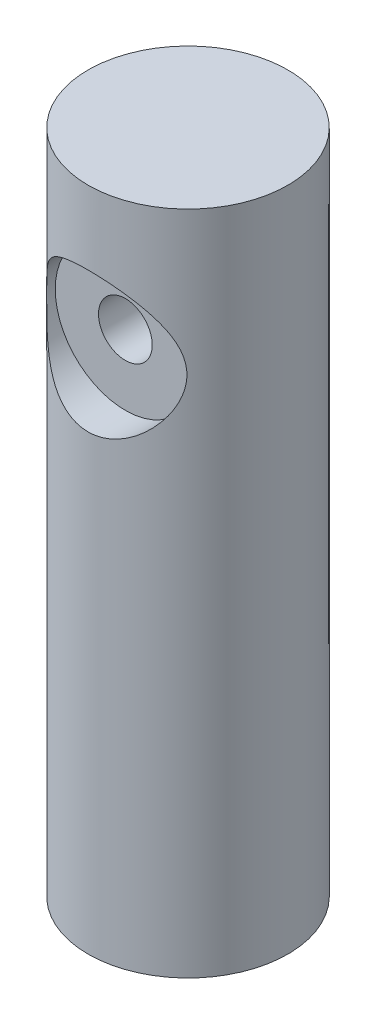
ISO-10303-21;
HEADER;
FILE_DESCRIPTION(('STEP AP214'),'2;1');
FILE_NAME('part.step','',(''),(''),'','','');
FILE_SCHEMA(('AUTOMOTIVE_DESIGN { 1 0 10303 214 1 1 1 1 }'));
ENDSEC;
DATA;
#1=APPLICATION_CONTEXT('core data for automotive mechanical design processes');
#2=APPLICATION_PROTOCOL_DEFINITION('international standard','automotive_design',2000,#1);
#3=PRODUCT_CONTEXT('',#1,'mechanical');
#4=PRODUCT('Part','Part','',(#3));
#5=PRODUCT_RELATED_PRODUCT_CATEGORY('part','',(#4));
#6=PRODUCT_DEFINITION_FORMATION('','',#4);
#7=PRODUCT_DEFINITION_CONTEXT('part definition',#1,'design');
#8=PRODUCT_DEFINITION('design','',#6,#7);
#9=PRODUCT_DEFINITION_SHAPE('','',#8);
#10=(LENGTH_UNIT() NAMED_UNIT(*) SI_UNIT(.MILLI.,.METRE.));
#11=(NAMED_UNIT(*) PLANE_ANGLE_UNIT() SI_UNIT($,.RADIAN.));
#12=(NAMED_UNIT(*) SI_UNIT($,.STERADIAN.) SOLID_ANGLE_UNIT());
#13=UNCERTAINTY_MEASURE_WITH_UNIT(LENGTH_MEASURE(1.E-05),#10,'distance_accuracy_value','');
#14=(GEOMETRIC_REPRESENTATION_CONTEXT(3) GLOBAL_UNCERTAINTY_ASSIGNED_CONTEXT((#13)) GLOBAL_UNIT_ASSIGNED_CONTEXT((#10,
#11,#12)) REPRESENTATION_CONTEXT('',''));
#15=CARTESIAN_POINT('',(0.,0.,0.));
#16=DIRECTION('',(0.,0.,1.));
#17=DIRECTION('',(1.,0.,0.));
#18=AXIS2_PLACEMENT_3D('',#15,#16,#17);
#19=CARTESIAN_POINT('',(0.,100.,0.));
#20=DIRECTION('',(0.,-1.,0.));
#21=DIRECTION('',(0.,0.,-1.));
#22=AXIS2_PLACEMENT_3D('',#19,#20,#21);
#23=CYLINDRICAL_SURFACE('',#22,15.);
#24=CARTESIAN_POINT('',(0.,67.9178628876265,15.));
#25=CARTESIAN_POINT('',(-0.261586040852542,67.9178616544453,15.0000011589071));
#26=CARTESIAN_POINT('',(-0.523157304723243,67.9276259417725,14.9931437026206));
#27=CARTESIAN_POINT('',(-1.04412788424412,67.9665175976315,14.9658886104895));
#28=CARTESIAN_POINT('',(-1.3035273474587,67.9956436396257,14.9454919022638));
#29=CARTESIAN_POINT('',(-1.81816208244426,68.0728013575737,14.8916503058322));
#30=CARTESIAN_POINT('',(-2.07339652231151,68.1208367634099,14.8582028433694));
#31=CARTESIAN_POINT('',(-2.57780900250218,68.2350956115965,14.7790420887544));
#32=CARTESIAN_POINT('',(-2.82698685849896,68.3013196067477,14.7333284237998));
#33=CARTESIAN_POINT('',(-3.31642499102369,68.4506686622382,14.6309099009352));
#34=CARTESIAN_POINT('',(-3.55672453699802,68.5337050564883,14.5742627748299));
#35=CARTESIAN_POINT('',(-4.0285553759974,68.7159341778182,14.4509595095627));
#36=CARTESIAN_POINT('',(-4.26008318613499,68.8151332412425,14.3842994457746));
#37=CARTESIAN_POINT('',(-4.71317375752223,69.0286080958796,14.2422731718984));
#38=CARTESIAN_POINT('',(-4.93474006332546,69.1428784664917,14.1669100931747));
#39=CARTESIAN_POINT('',(-5.36729789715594,69.3855789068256,14.0087534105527));
#40=CARTESIAN_POINT('',(-5.57828545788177,69.5140142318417,13.9259570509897));
#41=CARTESIAN_POINT('',(-6.00716027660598,69.7960277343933,13.746734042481));
#42=CARTESIAN_POINT('',(-6.22401264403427,69.9508245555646,13.6497493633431));
#43=CARTESIAN_POINT('',(-6.64385243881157,70.2750338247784,13.4503991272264));
#44=CARTESIAN_POINT('',(-6.84683941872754,70.4444467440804,13.3480333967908));
#45=CARTESIAN_POINT('',(-7.23882664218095,70.7972950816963,13.1395865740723));
#46=CARTESIAN_POINT('',(-7.42780508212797,70.9807514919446,13.0335000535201));
#47=CARTESIAN_POINT('',(-7.79101957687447,71.3607220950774,12.819688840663));
#48=CARTESIAN_POINT('',(-7.96525867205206,71.5572335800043,12.7119644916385));
#49=CARTESIAN_POINT('',(-8.32824462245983,71.9988150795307,12.4777750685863));
#50=CARTESIAN_POINT('',(-8.51408614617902,72.2463169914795,12.351373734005));
#51=CARTESIAN_POINT('',(-8.86415429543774,72.7581951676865,12.1025985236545));
#52=CARTESIAN_POINT('',(-9.02837527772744,73.0225758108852,11.980225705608));
#53=CARTESIAN_POINT('',(-9.33390099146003,73.5673085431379,11.7437455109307));
#54=CARTESIAN_POINT('',(-9.47523476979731,73.8476397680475,11.6296277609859));
#55=CARTESIAN_POINT('',(-9.73373583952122,74.423869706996,11.4141446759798));
#56=CARTESIAN_POINT('',(-9.85091590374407,74.719760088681,11.3127726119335));
#57=CARTESIAN_POINT('',(-10.0266710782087,75.231085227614,11.1568383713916));
#58=CARTESIAN_POINT('',(-10.0921128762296,75.4427383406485,11.0975522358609));
#59=CARTESIAN_POINT('',(-10.2100149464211,75.872160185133,10.9891769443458));
#60=CARTESIAN_POINT('',(-10.2624790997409,76.089927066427,10.9400847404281));
#61=CARTESIAN_POINT('',(-10.3536533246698,76.5302738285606,10.853838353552));
#62=CARTESIAN_POINT('',(-10.3923864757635,76.7528449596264,10.816664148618));
#63=CARTESIAN_POINT('',(-10.455584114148,77.2018310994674,10.7555893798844));
#64=CARTESIAN_POINT('',(-10.4800485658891,77.428246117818,10.7316888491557));
#65=CARTESIAN_POINT('',(-10.5143415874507,77.884587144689,10.6980937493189));
#66=CARTESIAN_POINT('',(-10.5240836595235,78.1145259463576,10.6884831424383));
#67=CARTESIAN_POINT('',(-10.5284551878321,78.5746821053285,10.6841771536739));
#68=CARTESIAN_POINT('',(-10.5230850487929,78.804899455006,10.6894813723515));
#69=CARTESIAN_POINT('',(-10.4973359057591,79.2638479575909,10.7147682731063));
#70=CARTESIAN_POINT('',(-10.4769454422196,79.4925778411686,10.7347621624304));
#71=CARTESIAN_POINT('',(-10.4215478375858,79.9466119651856,10.7885502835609));
#72=CARTESIAN_POINT('',(-10.3865390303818,80.1719158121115,10.8223460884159));
#73=CARTESIAN_POINT('',(-10.296716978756,80.6483663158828,10.9078859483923));
#74=CARTESIAN_POINT('',(-10.2398389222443,80.8987939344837,10.9614619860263));
#75=CARTESIAN_POINT('',(-10.1089960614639,81.3917455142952,11.0822426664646));
#76=CARTESIAN_POINT('',(-10.0350285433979,81.6342682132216,11.1494494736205));
#77=CARTESIAN_POINT('',(-9.87091680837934,82.1108004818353,11.2950006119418));
#78=CARTESIAN_POINT('',(-9.78074450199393,82.3447944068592,11.3733642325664));
#79=CARTESIAN_POINT('',(-9.58524761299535,82.8032182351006,11.5386053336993));
#80=CARTESIAN_POINT('',(-9.47992179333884,83.0276473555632,11.6254835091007));
#81=CARTESIAN_POINT('',(-9.22276211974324,83.5292437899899,11.8310995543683));
#82=CARTESIAN_POINT('',(-9.06623346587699,83.8031850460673,11.9518543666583));
#83=CARTESIAN_POINT('',(-8.73064684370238,84.334160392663,12.1991508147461));
#84=CARTESIAN_POINT('',(-8.55158305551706,84.5911900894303,12.3256939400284));
#85=CARTESIAN_POINT('',(-8.17169239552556,85.0879210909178,12.580772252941));
#86=CARTESIAN_POINT('',(-7.9708493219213,85.3276092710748,12.7093088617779));
#87=CARTESIAN_POINT('',(-7.54821027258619,85.7886284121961,12.9647790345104));
#88=CARTESIAN_POINT('',(-7.32641628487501,86.0099611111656,13.0917127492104));
#89=CARTESIAN_POINT('',(-6.8606281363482,86.4348689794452,13.3417466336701));
#90=CARTESIAN_POINT('',(-6.6164718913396,86.6382894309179,13.4648084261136));
#91=CARTESIAN_POINT('',(-6.10817806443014,87.0238998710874,13.702879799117));
#92=CARTESIAN_POINT('',(-5.84403860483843,87.2060878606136,13.8178886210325));
#93=CARTESIAN_POINT('',(-5.29735104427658,87.547024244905,14.0365443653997));
#94=CARTESIAN_POINT('',(-5.01483908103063,87.7058167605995,14.1402125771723));
#95=CARTESIAN_POINT('',(-4.43250385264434,87.9982087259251,14.3334192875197));
#96=CARTESIAN_POINT('',(-4.13268708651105,88.1318175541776,14.4229630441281));
#97=CARTESIAN_POINT('',(-3.59591399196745,88.3411938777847,14.5645374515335));
#98=CARTESIAN_POINT('',(-3.36229805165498,88.4230371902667,14.6203226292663));
#99=CARTESIAN_POINT('',(-2.88781496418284,88.5705422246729,14.7213897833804));
#100=CARTESIAN_POINT('',(-2.64694935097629,88.636207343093,14.7666739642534));
#101=CARTESIAN_POINT('',(-2.15949050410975,88.7505079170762,14.8457919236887));
#102=CARTESIAN_POINT('',(-1.91290032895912,88.7991522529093,14.8796316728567));
#103=CARTESIAN_POINT('',(-1.41551408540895,88.8787865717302,14.9351575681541));
#104=CARTESIAN_POINT('',(-1.16471789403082,88.9097760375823,14.9568433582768));
#105=CARTESIAN_POINT('',(-0.660068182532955,88.9536978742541,14.9876078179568));
#106=CARTESIAN_POINT('',(-0.406208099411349,88.9665797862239,14.9966512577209));
#107=CARTESIAN_POINT('',(0.101910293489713,88.9739245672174,15.0018054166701));
#108=CARTESIAN_POINT('',(0.356168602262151,88.9683874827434,14.9979161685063));
#109=CARTESIAN_POINT('',(0.863126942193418,88.9389791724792,14.9772955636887));
#110=CARTESIAN_POINT('',(1.11582676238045,88.9151055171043,14.9605625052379));
#111=CARTESIAN_POINT('',(1.61772065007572,88.8493843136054,14.9146398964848));
#112=CARTESIAN_POINT('',(1.86691476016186,88.8075369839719,14.8854504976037));
#113=CARTESIAN_POINT('',(2.35016176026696,88.7084990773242,14.8166767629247));
#114=CARTESIAN_POINT('',(2.58442133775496,88.6519901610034,14.7775555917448));
#115=CARTESIAN_POINT('',(3.04673491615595,88.5236602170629,14.6892066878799));
#116=CARTESIAN_POINT('',(3.27478912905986,88.4518397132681,14.6399793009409));
#117=CARTESIAN_POINT('',(3.72353488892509,88.2936801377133,14.5323271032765));
#118=CARTESIAN_POINT('',(3.94422699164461,88.2073421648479,14.4739029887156));
#119=CARTESIAN_POINT('',(4.37741055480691,88.0209454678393,14.3488371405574));
#120=CARTESIAN_POINT('',(4.58989898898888,87.920881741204,14.2821924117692));
#121=CARTESIAN_POINT('',(5.02590757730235,87.6976192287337,14.1349979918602));
#122=CARTESIAN_POINT('',(5.24851837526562,87.5731203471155,14.0537272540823));
#123=CARTESIAN_POINT('',(5.68224886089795,87.3096410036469,13.884030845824));
#124=CARTESIAN_POINT('',(5.89336362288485,87.170654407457,13.7956021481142));
#125=CARTESIAN_POINT('',(6.30357174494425,86.879101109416,13.613060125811));
#126=CARTESIAN_POINT('',(6.50265887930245,86.7265274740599,13.5189439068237));
#127=CARTESIAN_POINT('',(6.88829909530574,86.4086602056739,13.3265816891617));
#128=CARTESIAN_POINT('',(7.07485078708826,86.2433651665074,13.2283352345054));
#129=CARTESIAN_POINT('',(7.46715220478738,85.8702215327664,13.0115482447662));
#130=CARTESIAN_POINT('',(7.67040842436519,85.6600356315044,12.8925082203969));
#131=CARTESIAN_POINT('',(8.05856714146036,85.2237752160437,12.6535154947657));
#132=CARTESIAN_POINT('',(8.24346637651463,84.9976978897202,12.5335626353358));
#133=CARTESIAN_POINT('',(8.59436838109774,84.5302158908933,12.2956000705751));
#134=CARTESIAN_POINT('',(8.76036484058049,84.2888061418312,12.177591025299));
#135=CARTESIAN_POINT('',(9.07261766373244,83.791214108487,11.9467687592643));
#136=CARTESIAN_POINT('',(9.21887824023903,83.5350349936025,11.8339544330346));
#137=CARTESIAN_POINT('',(9.46599635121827,83.0561252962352,11.6368028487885));
#138=CARTESIAN_POINT('',(9.57027720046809,82.8357565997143,11.5510120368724));
#139=CARTESIAN_POINT('',(9.76421621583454,82.3857302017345,11.3875442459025));
#140=CARTESIAN_POINT('',(9.85387493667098,82.156072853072,11.3098669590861));
#141=CARTESIAN_POINT('',(10.0175404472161,81.6884452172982,11.1651603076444));
#142=CARTESIAN_POINT('',(10.0915744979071,81.4504902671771,11.0981124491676));
#143=CARTESIAN_POINT('',(10.2231839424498,80.966832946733,10.9769999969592));
#144=CARTESIAN_POINT('',(10.280762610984,80.7211321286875,10.9229328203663));
#145=CARTESIAN_POINT('',(10.3706257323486,80.2633485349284,10.8375882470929));
#146=CARTESIAN_POINT('',(10.4054856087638,80.0521923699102,10.8040467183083));
#147=CARTESIAN_POINT('',(10.4623731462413,79.6266218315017,10.7489686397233));
#148=CARTESIAN_POINT('',(10.4844032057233,79.4122080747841,10.7274298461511));
#149=CARTESIAN_POINT('',(10.515249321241,78.9816621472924,10.6971960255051));
#150=CARTESIAN_POINT('',(10.524073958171,78.7655311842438,10.6884926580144));
#151=CARTESIAN_POINT('',(10.5283743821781,78.333000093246,10.6842567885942));
#152=CARTESIAN_POINT('',(10.5238498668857,78.1165999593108,10.6887245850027));
#153=CARTESIAN_POINT('',(10.5015487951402,77.6854138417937,10.7106354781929));
#154=CARTESIAN_POINT('',(10.4837880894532,77.4706262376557,10.7280630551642));
#155=CARTESIAN_POINT('',(10.4353471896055,77.0438939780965,10.7751873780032));
#156=CARTESIAN_POINT('',(10.4046670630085,76.8319493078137,10.804884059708));
#157=CARTESIAN_POINT('',(10.3308332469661,76.4119366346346,10.8754993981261));
#158=CARTESIAN_POINT('',(10.2876669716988,76.2038727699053,10.916429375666));
#159=CARTESIAN_POINT('',(10.1894303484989,75.7927066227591,11.0081797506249));
#160=CARTESIAN_POINT('',(10.1343532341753,75.5896072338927,11.0590057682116));
#161=CARTESIAN_POINT('',(9.99069662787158,75.1159512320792,11.1892135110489));
#162=CARTESIAN_POINT('',(9.89722969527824,74.8478700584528,11.2722425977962));
#163=CARTESIAN_POINT('',(9.69068469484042,74.323637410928,11.4502926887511));
#164=CARTESIAN_POINT('',(9.57760764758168,74.0674853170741,11.5453130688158));
#165=CARTESIAN_POINT('',(9.3328053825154,73.5672345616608,11.7440896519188));
#166=CARTESIAN_POINT('',(9.20104910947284,73.3231569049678,11.8478602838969));
#167=CARTESIAN_POINT('',(8.9199659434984,72.8479325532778,12.0608998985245));
#168=CARTESIAN_POINT('',(8.7706406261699,72.6167847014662,12.1701683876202));
#169=CARTESIAN_POINT('',(8.451250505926,72.1622728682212,12.3941652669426));
#170=CARTESIAN_POINT('',(8.28076936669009,71.9392352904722,12.5089618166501));
#171=CARTESIAN_POINT('',(7.92262718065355,71.5075341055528,12.7388091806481));
#172=CARTESIAN_POINT('',(7.73496542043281,71.2988710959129,12.8538600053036));
#173=CARTESIAN_POINT('',(7.34310950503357,70.8967718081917,13.0816688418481));
#174=CARTESIAN_POINT('',(7.13893102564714,70.7033214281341,13.1944289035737));
#175=CARTESIAN_POINT('',(6.71426346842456,70.3322376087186,13.415512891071));
#176=CARTESIAN_POINT('',(6.49376891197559,70.1546095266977,13.5238353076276));
#177=CARTESIAN_POINT('',(6.04887744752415,69.8250920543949,13.7283607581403));
#178=CARTESIAN_POINT('',(5.82526986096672,69.672347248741,13.8249007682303));
#179=CARTESIAN_POINT('',(5.36466983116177,69.3833415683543,14.0100637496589));
#180=CARTESIAN_POINT('',(5.12768415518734,69.2470724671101,14.0986906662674));
#181=CARTESIAN_POINT('',(4.64108304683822,68.9921936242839,14.2662734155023));
#182=CARTESIAN_POINT('',(4.39146716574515,68.8735845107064,14.3452289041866));
#183=CARTESIAN_POINT('',(3.88079766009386,68.6553866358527,14.4917202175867));
#184=CARTESIAN_POINT('',(3.61974419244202,68.55579761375,14.5592561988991));
#185=CARTESIAN_POINT('',(3.08806902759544,68.3770988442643,14.6812164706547));
#186=CARTESIAN_POINT('',(2.81745875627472,68.2979655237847,14.7356558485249));
#187=CARTESIAN_POINT('',(2.2683548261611,68.1612737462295,14.8301098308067));
#188=CARTESIAN_POINT('',(1.98986119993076,68.1037152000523,14.8701244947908));
#189=CARTESIAN_POINT('',(1.42754666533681,68.0112192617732,14.9345953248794));
#190=CARTESIAN_POINT('',(1.14372949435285,67.9762665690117,14.9590620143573));
#191=CARTESIAN_POINT('',(0.57326879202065,67.9295901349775,14.9917629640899));
#192=CARTESIAN_POINT('',(0.286625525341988,67.9178642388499,14.9999987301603));
#193=CARTESIAN_POINT('',(0.,67.9178628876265,15.));
#194=B_SPLINE_CURVE_WITH_KNOTS('',3,(#24,#25,#26,#27,#28,#29,#30,#31,#32,#33,#34,#35,#36,#37,
#38,#39,#40,#41,#42,#43,#44,#45,#46,#47,#48,#49,#50,#51,#52,#53,#54,#55,#56,#57,#58,#59,#60,#61,
#62,#63,#64,#65,#66,#67,#68,#69,#70,#71,#72,#73,#74,#75,#76,#77,#78,#79,#80,#81,#82,#83,#84,#85,
#86,#87,#88,#89,#90,#91,#92,#93,#94,#95,#96,#97,#98,#99,#100,#101,#102,#103,#104,#105,#106,#107,
#108,#109,#110,#111,#112,#113,#114,#115,#116,#117,#118,#119,#120,#121,#122,#123,#124,#125,#126,
#127,#128,#129,#130,#131,#132,#133,#134,#135,#136,#137,#138,#139,#140,#141,#142,#143,#144,#145,
#146,#147,#148,#149,#150,#151,#152,#153,#154,#155,#156,#157,#158,#159,#160,#161,#162,#163,#164,
#165,#166,#167,#168,#169,#170,#171,#172,#173,#174,#175,#176,#177,#178,#179,#180,#181,#182,#183,
#184,#185,#186,#187,#188,#189,#190,#191,#192,#193),.UNSPECIFIED.,.T.,.F.,(4,2,2,2,2,2,2,2,2,2,2,
2,2,2,2,2,2,2,2,2,2,2,2,2,2,2,2,2,2,2,2,2,2,2,2,2,2,2,2,2,2,2,2,2,2,2,2,2,2,2,2,2,2,2,2,2,2,2,2,
2,2,2,2,2,2,2,2,2,2,2,2,2,2,2,2,2,2,2,2,2,2,2,2,2,4),(0.,0.784463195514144,1.56887265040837,
2.35343690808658,3.13802501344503,3.91857832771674,4.69943838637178,5.48001836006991,
6.26088891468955,7.11068685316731,7.96051220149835,8.81163363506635,9.66257907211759,
10.6644025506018,11.6664870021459,12.667289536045,13.6675614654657,14.3549759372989,
15.04218457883,15.7282326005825,16.4142823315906,17.1043473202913,17.794393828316,
18.4849673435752,19.175619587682,19.9614802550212,20.7474658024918,21.5348271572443,
22.3222528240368,23.3343792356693,24.3467675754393,25.3599142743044,26.3729649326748,
27.3940482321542,28.4152275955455,29.4344557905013,30.4533036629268,31.2137752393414,
31.9740870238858,32.7340015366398,33.493938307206,34.2559885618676,35.0180368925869,
35.7801862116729,36.5423262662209,37.2739409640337,38.0055306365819,38.7370649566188,
39.4688666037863,40.2711691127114,41.0738127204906,41.8768682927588,42.6800127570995,
43.6261178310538,44.572390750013,45.5189786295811,46.4653641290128,47.2400811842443,
48.0147688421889,48.7880934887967,49.5612641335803,50.2104607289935,50.859535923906,
51.5081891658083,52.1568571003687,52.804749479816,53.4526384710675,54.1011828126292,
54.7500965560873,55.6361799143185,56.522217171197,57.409745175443,58.2971936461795,
59.2062428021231,60.1153297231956,61.0235637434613,61.9321041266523,62.7937338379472,
63.6549315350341,64.5161598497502,65.3773763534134,66.2375959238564,67.0978119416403,
67.9574451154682,68.8169985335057),.UNSPECIFIED.);
#195=CARTESIAN_POINT('',(0.,67.9178628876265,15.));
#196=VERTEX_POINT('',#195);
#197=EDGE_CURVE('E10',#196,#196,#194,.T.);
#198=ORIENTED_EDGE('',*,*,#197,.T.);
#199=EDGE_LOOP('',(#198));
#200=FACE_BOUND('',#199,.T.);
#201=CARTESIAN_POINT('',(0.,88.9713517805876,-15.));
#202=CARTESIAN_POINT('',(-0.261586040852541,88.9713530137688,-15.0000011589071));
#203=CARTESIAN_POINT('',(-0.523157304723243,88.9615887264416,-14.9931437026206));
#204=CARTESIAN_POINT('',(-1.04412788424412,88.9226970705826,-14.9658886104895));
#205=CARTESIAN_POINT('',(-1.3035273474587,88.8935710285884,-14.9454919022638));
#206=CARTESIAN_POINT('',(-1.81816208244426,88.8164133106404,-14.8916503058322));
#207=CARTESIAN_POINT('',(-2.07339652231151,88.7683779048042,-14.8582028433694));
#208=CARTESIAN_POINT('',(-2.57780900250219,88.6541190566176,-14.7790420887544));
#209=CARTESIAN_POINT('',(-2.82698685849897,88.5878950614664,-14.7333284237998));
#210=CARTESIAN_POINT('',(-3.31642499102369,88.4385460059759,-14.6309099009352));
#211=CARTESIAN_POINT('',(-3.55672453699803,88.3555096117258,-14.5742627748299));
#212=CARTESIAN_POINT('',(-4.02855537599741,88.1732804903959,-14.4509595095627));
#213=CARTESIAN_POINT('',(-4.26008318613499,88.0740814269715,-14.3842994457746));
#214=CARTESIAN_POINT('',(-4.71317375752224,87.8606065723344,-14.2422731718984));
#215=CARTESIAN_POINT('',(-4.93474006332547,87.7463362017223,-14.1669100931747));
#216=CARTESIAN_POINT('',(-5.36729789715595,87.5036357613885,-14.0087534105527));
#217=CARTESIAN_POINT('',(-5.57828545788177,87.3752004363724,-13.9259570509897));
#218=CARTESIAN_POINT('',(-6.00716027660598,87.0931869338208,-13.746734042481));
#219=CARTESIAN_POINT('',(-6.22401264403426,86.9383901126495,-13.6497493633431));
#220=CARTESIAN_POINT('',(-6.64385243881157,86.6141808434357,-13.4503991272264));
#221=CARTESIAN_POINT('',(-6.84683941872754,86.4447679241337,-13.3480333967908));
#222=CARTESIAN_POINT('',(-7.23882664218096,86.0919195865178,-13.1395865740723));
#223=CARTESIAN_POINT('',(-7.42780508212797,85.9084631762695,-13.0335000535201));
#224=CARTESIAN_POINT('',(-7.79101957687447,85.5284925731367,-12.819688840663));
#225=CARTESIAN_POINT('',(-7.96525867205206,85.3319810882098,-12.7119644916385));
#226=CARTESIAN_POINT('',(-8.32824462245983,84.8903995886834,-12.4777750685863));
#227=CARTESIAN_POINT('',(-8.51408614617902,84.6428976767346,-12.351373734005));
#228=CARTESIAN_POINT('',(-8.86415429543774,84.1310195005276,-12.1025985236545));
#229=CARTESIAN_POINT('',(-9.02837527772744,83.8666388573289,-11.980225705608));
#230=CARTESIAN_POINT('',(-9.33390099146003,83.3219061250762,-11.7437455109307));
#231=CARTESIAN_POINT('',(-9.47523476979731,83.0415749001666,-11.6296277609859));
#232=CARTESIAN_POINT('',(-9.73373583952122,82.4653449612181,-11.4141446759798));
#233=CARTESIAN_POINT('',(-9.85091590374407,82.1694545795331,-11.3127726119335));
#234=CARTESIAN_POINT('',(-10.0266710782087,81.6581294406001,-11.1568383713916));
#235=CARTESIAN_POINT('',(-10.0921128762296,81.4464763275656,-11.0975522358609));
#236=CARTESIAN_POINT('',(-10.2100149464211,81.0170544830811,-10.9891769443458));
#237=CARTESIAN_POINT('',(-10.2624790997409,80.7992876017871,-10.9400847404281));
#238=CARTESIAN_POINT('',(-10.3536533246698,80.3589408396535,-10.853838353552));
#239=CARTESIAN_POINT('',(-10.3923864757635,80.1363697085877,-10.816664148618));
#240=CARTESIAN_POINT('',(-10.455584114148,79.6873835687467,-10.7555893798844));
#241=CARTESIAN_POINT('',(-10.4800485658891,79.4609685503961,-10.7316888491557));
#242=CARTESIAN_POINT('',(-10.5143415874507,79.0046275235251,-10.6980937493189));
#243=CARTESIAN_POINT('',(-10.5240836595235,78.7746887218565,-10.6884831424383));
#244=CARTESIAN_POINT('',(-10.5284551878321,78.3145325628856,-10.6841771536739));
#245=CARTESIAN_POINT('',(-10.5230850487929,78.0843152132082,-10.6894813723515));
#246=CARTESIAN_POINT('',(-10.4973359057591,77.6253667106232,-10.7147682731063));
#247=CARTESIAN_POINT('',(-10.4769454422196,77.3966368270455,-10.7347621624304));
#248=CARTESIAN_POINT('',(-10.4215478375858,76.9426027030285,-10.7885502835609));
#249=CARTESIAN_POINT('',(-10.3865390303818,76.7172988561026,-10.8223460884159));
#250=CARTESIAN_POINT('',(-10.296716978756,76.2408483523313,-10.9078859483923));
#251=CARTESIAN_POINT('',(-10.2398389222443,75.9904207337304,-10.9614619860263));
#252=CARTESIAN_POINT('',(-10.1089960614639,75.4974691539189,-11.0822426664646));
#253=CARTESIAN_POINT('',(-10.0350285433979,75.2549464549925,-11.1494494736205));
#254=CARTESIAN_POINT('',(-9.87091680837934,74.7784141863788,-11.2950006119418));
#255=CARTESIAN_POINT('',(-9.78074450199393,74.5444202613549,-11.3733642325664));
#256=CARTESIAN_POINT('',(-9.58524761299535,74.0859964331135,-11.5386053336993));
#257=CARTESIAN_POINT('',(-9.47992179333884,73.8615673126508,-11.6254835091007));
#258=CARTESIAN_POINT('',(-9.22276211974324,73.3599708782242,-11.8310995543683));
#259=CARTESIAN_POINT('',(-9.06623346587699,73.0860296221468,-11.9518543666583));
#260=CARTESIAN_POINT('',(-8.73064684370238,72.5550542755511,-12.1991508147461));
#261=CARTESIAN_POINT('',(-8.55158305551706,72.2980245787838,-12.3256939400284));
#262=CARTESIAN_POINT('',(-8.17169239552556,71.8012935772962,-12.580772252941));
#263=CARTESIAN_POINT('',(-7.9708493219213,71.5616053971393,-12.7093088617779));
#264=CARTESIAN_POINT('',(-7.54821027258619,71.100586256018,-12.9647790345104));
#265=CARTESIAN_POINT('',(-7.32641628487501,70.8792535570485,-13.0917127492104));
#266=CARTESIAN_POINT('',(-6.86062813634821,70.4543456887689,-13.3417466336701));
#267=CARTESIAN_POINT('',(-6.6164718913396,70.2509252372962,-13.4648084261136));
#268=CARTESIAN_POINT('',(-6.10817806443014,69.8653147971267,-13.702879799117));
#269=CARTESIAN_POINT('',(-5.84403860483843,69.6831268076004,-13.8178886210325));
#270=CARTESIAN_POINT('',(-5.29735104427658,69.3421904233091,-14.0365443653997));
#271=CARTESIAN_POINT('',(-5.01483908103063,69.1833979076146,-14.1402125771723));
#272=CARTESIAN_POINT('',(-4.43250385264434,68.891005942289,-14.3334192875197));
#273=CARTESIAN_POINT('',(-4.13268708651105,68.7573971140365,-14.4229630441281));
#274=CARTESIAN_POINT('',(-3.59591399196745,68.5480207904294,-14.5645374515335));
#275=CARTESIAN_POINT('',(-3.36229805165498,68.4661774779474,-14.6203226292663));
#276=CARTESIAN_POINT('',(-2.88781496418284,68.3186724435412,-14.7213897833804));
#277=CARTESIAN_POINT('',(-2.64694935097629,68.2530073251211,-14.7666739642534));
#278=CARTESIAN_POINT('',(-2.15949050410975,68.1387067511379,-14.8457919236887));
#279=CARTESIAN_POINT('',(-1.91290032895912,68.0900624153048,-14.8796316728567));
#280=CARTESIAN_POINT('',(-1.41551408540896,68.0104280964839,-14.9351575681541));
#281=CARTESIAN_POINT('',(-1.16471789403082,67.9794386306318,-14.9568433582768));
#282=CARTESIAN_POINT('',(-0.660068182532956,67.93551679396,-14.9876078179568));
#283=CARTESIAN_POINT('',(-0.406208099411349,67.9226348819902,-14.9966512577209));
#284=CARTESIAN_POINT('',(0.101910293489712,67.9152901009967,-15.0018054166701));
#285=CARTESIAN_POINT('',(0.35616860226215,67.9208271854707,-14.9979161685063));
#286=CARTESIAN_POINT('',(0.863126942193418,67.9502354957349,-14.9772955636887));
#287=CARTESIAN_POINT('',(1.11582676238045,67.9741091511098,-14.9605625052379));
#288=CARTESIAN_POINT('',(1.61772065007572,68.0398303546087,-14.9146398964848));
#289=CARTESIAN_POINT('',(1.86691476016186,68.0816776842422,-14.8854504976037));
#290=CARTESIAN_POINT('',(2.35016176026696,68.1807155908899,-14.8166767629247));
#291=CARTESIAN_POINT('',(2.58442133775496,68.2372245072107,-14.7775555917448));
#292=CARTESIAN_POINT('',(3.04673491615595,68.3655544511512,-14.6892066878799));
#293=CARTESIAN_POINT('',(3.27478912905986,68.437374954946,-14.6399793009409));
#294=CARTESIAN_POINT('',(3.72353488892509,68.5955345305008,-14.5323271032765));
#295=CARTESIAN_POINT('',(3.94422699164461,68.6818725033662,-14.4739029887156));
#296=CARTESIAN_POINT('',(4.37741055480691,68.8682692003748,-14.3488371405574));
#297=CARTESIAN_POINT('',(4.58989898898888,68.9683329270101,-14.2821924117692));
#298=CARTESIAN_POINT('',(5.02590757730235,69.1915954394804,-14.1349979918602));
#299=CARTESIAN_POINT('',(5.24851837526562,69.3160943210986,-14.0537272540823));
#300=CARTESIAN_POINT('',(5.68224886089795,69.5795736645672,-13.884030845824));
#301=CARTESIAN_POINT('',(5.89336362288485,69.7185602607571,-13.7956021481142));
#302=CARTESIAN_POINT('',(6.30357174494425,70.0101135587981,-13.613060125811));
#303=CARTESIAN_POINT('',(6.50265887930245,70.1626871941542,-13.5189439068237));
#304=CARTESIAN_POINT('',(6.88829909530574,70.4805544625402,-13.3265816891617));
#305=CARTESIAN_POINT('',(7.07485078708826,70.6458495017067,-13.2283352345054));
#306=CARTESIAN_POINT('',(7.46715220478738,71.0189931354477,-13.0115482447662));
#307=CARTESIAN_POINT('',(7.67040842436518,71.2291790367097,-12.8925082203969));
#308=CARTESIAN_POINT('',(8.05856714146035,71.6654394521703,-12.6535154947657));
#309=CARTESIAN_POINT('',(8.24346637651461,71.8915167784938,-12.5335626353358));
#310=CARTESIAN_POINT('',(8.59436838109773,72.3589987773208,-12.2956000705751));
#311=CARTESIAN_POINT('',(8.76036484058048,72.6004085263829,-12.177591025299));
#312=CARTESIAN_POINT('',(9.07261766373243,73.0980005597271,-11.9467687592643));
#313=CARTESIAN_POINT('',(9.21887824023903,73.3541796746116,-11.8339544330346));
#314=CARTESIAN_POINT('',(9.46599635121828,73.8330893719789,-11.6368028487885));
#315=CARTESIAN_POINT('',(9.57027720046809,74.0534580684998,-11.5510120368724));
#316=CARTESIAN_POINT('',(9.76421621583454,74.5034844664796,-11.3875442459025));
#317=CARTESIAN_POINT('',(9.85387493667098,74.7331418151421,-11.309866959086));
#318=CARTESIAN_POINT('',(10.0175404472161,75.2007694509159,-11.1651603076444));
#319=CARTESIAN_POINT('',(10.0915744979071,75.438724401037,-11.0981124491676));
#320=CARTESIAN_POINT('',(10.2231839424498,75.9223817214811,-10.9769999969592));
#321=CARTESIAN_POINT('',(10.280762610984,76.1680825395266,-10.9229328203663));
#322=CARTESIAN_POINT('',(10.3706257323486,76.6258661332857,-10.8375882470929));
#323=CARTESIAN_POINT('',(10.4054856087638,76.8370222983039,-10.8040467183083));
#324=CARTESIAN_POINT('',(10.4623731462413,77.2625928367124,-10.7489686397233));
#325=CARTESIAN_POINT('',(10.4844032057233,77.47700659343,-10.7274298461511));
#326=CARTESIAN_POINT('',(10.515249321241,77.9075525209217,-10.6971960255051));
#327=CARTESIAN_POINT('',(10.524073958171,78.1236834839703,-10.6884926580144));
#328=CARTESIAN_POINT('',(10.5283743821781,78.5562145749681,-10.6842567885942));
#329=CARTESIAN_POINT('',(10.5238498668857,78.7726147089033,-10.6887245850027));
#330=CARTESIAN_POINT('',(10.5015487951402,79.2038008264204,-10.7106354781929));
#331=CARTESIAN_POINT('',(10.4837880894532,79.4185884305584,-10.7280630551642));
#332=CARTESIAN_POINT('',(10.4353471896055,79.8453206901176,-10.7751873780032));
#333=CARTESIAN_POINT('',(10.4046670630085,80.0572653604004,-10.804884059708));
#334=CARTESIAN_POINT('',(10.3308332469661,80.4772780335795,-10.8754993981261));
#335=CARTESIAN_POINT('',(10.2876669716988,80.6853418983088,-10.916429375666));
#336=CARTESIAN_POINT('',(10.1894303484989,81.096508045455,-11.0081797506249));
#337=CARTESIAN_POINT('',(10.1343532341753,81.2996074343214,-11.0590057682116));
#338=CARTESIAN_POINT('',(9.99069662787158,81.7732634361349,-11.1892135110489));
#339=CARTESIAN_POINT('',(9.89722969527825,82.0413446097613,-11.2722425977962));
#340=CARTESIAN_POINT('',(9.69068469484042,82.5655772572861,-11.4502926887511));
#341=CARTESIAN_POINT('',(9.57760764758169,82.82172935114,-11.5453130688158));
#342=CARTESIAN_POINT('',(9.3328053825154,83.3219801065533,-11.7440896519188));
#343=CARTESIAN_POINT('',(9.20104910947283,83.5660577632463,-11.8478602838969));
#344=CARTESIAN_POINT('',(8.91996594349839,84.0412821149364,-12.0608998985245));
#345=CARTESIAN_POINT('',(8.7706406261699,84.2724299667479,-12.1701683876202));
#346=CARTESIAN_POINT('',(8.451250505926,84.7269417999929,-12.3941652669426));
#347=CARTESIAN_POINT('',(8.28076936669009,84.9499793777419,-12.5089618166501));
#348=CARTESIAN_POINT('',(7.92262718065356,85.3816805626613,-12.7388091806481));
#349=CARTESIAN_POINT('',(7.73496542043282,85.5903435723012,-12.8538600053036));
#350=CARTESIAN_POINT('',(7.34310950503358,85.9924428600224,-13.0816688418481));
#351=CARTESIAN_POINT('',(7.13893102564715,86.18589324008,-13.1944289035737));
#352=CARTESIAN_POINT('',(6.71426346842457,86.5569770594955,-13.415512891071));
#353=CARTESIAN_POINT('',(6.49376891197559,86.7346051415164,-13.5238353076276));
#354=CARTESIAN_POINT('',(6.04887744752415,87.0641226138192,-13.7283607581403));
#355=CARTESIAN_POINT('',(5.82526986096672,87.2168674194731,-13.8249007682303));
#356=CARTESIAN_POINT('',(5.36466983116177,87.5058730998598,-14.0100637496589));
#357=CARTESIAN_POINT('',(5.12768415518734,87.642142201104,-14.0986906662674));
#358=CARTESIAN_POINT('',(4.64108304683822,87.8970210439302,-14.2662734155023));
#359=CARTESIAN_POINT('',(4.39146716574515,88.0156301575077,-14.3452289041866));
#360=CARTESIAN_POINT('',(3.88079766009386,88.2338280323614,-14.4917202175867));
#361=CARTESIAN_POINT('',(3.61974419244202,88.3334170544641,-14.5592561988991));
#362=CARTESIAN_POINT('',(3.08806902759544,88.5121158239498,-14.6812164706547));
#363=CARTESIAN_POINT('',(2.81745875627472,88.5912491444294,-14.7356558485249));
#364=CARTESIAN_POINT('',(2.2683548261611,88.7279409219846,-14.8301098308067));
#365=CARTESIAN_POINT('',(1.98986119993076,88.7854994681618,-14.8701244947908));
#366=CARTESIAN_POINT('',(1.42754666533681,88.8779954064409,-14.9345953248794));
#367=CARTESIAN_POINT('',(1.14372949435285,88.9129480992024,-14.9590620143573));
#368=CARTESIAN_POINT('',(0.57326879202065,88.9596245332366,-14.9917629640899));
#369=CARTESIAN_POINT('',(0.286625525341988,88.9713504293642,-14.9999987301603));
#370=CARTESIAN_POINT('',(0.,88.9713517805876,-15.));
#371=B_SPLINE_CURVE_WITH_KNOTS('',3,(#201,#202,#203,#204,#205,#206,#207,#208,#209,#210,#211,
#212,#213,#214,#215,#216,#217,#218,#219,#220,#221,#222,#223,#224,#225,#226,#227,#228,#229,#230,
#231,#232,#233,#234,#235,#236,#237,#238,#239,#240,#241,#242,#243,#244,#245,#246,#247,#248,#249,
#250,#251,#252,#253,#254,#255,#256,#257,#258,#259,#260,#261,#262,#263,#264,#265,#266,#267,#268,
#269,#270,#271,#272,#273,#274,#275,#276,#277,#278,#279,#280,#281,#282,#283,#284,#285,#286,#287,
#288,#289,#290,#291,#292,#293,#294,#295,#296,#297,#298,#299,#300,#301,#302,#303,#304,#305,#306,
#307,#308,#309,#310,#311,#312,#313,#314,#315,#316,#317,#318,#319,#320,#321,#322,#323,#324,#325,
#326,#327,#328,#329,#330,#331,#332,#333,#334,#335,#336,#337,#338,#339,#340,#341,#342,#343,#344,
#345,#346,#347,#348,#349,#350,#351,#352,#353,#354,#355,#356,#357,#358,#359,#360,#361,#362,#363,
#364,#365,#366,#367,#368,#369,#370),.UNSPECIFIED.,.T.,.F.,(4,2,2,2,2,2,2,2,2,2,2,2,2,2,2,2,2,2,
2,2,2,2,2,2,2,2,2,2,2,2,2,2,2,2,2,2,2,2,2,2,2,2,2,2,2,2,2,2,2,2,2,2,2,2,2,2,2,2,2,2,2,2,2,2,2,2,
2,2,2,2,2,2,2,2,2,2,2,2,2,2,2,2,2,2,4),(0.,0.784463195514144,1.56887265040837,2.35343690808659,
3.13802501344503,3.91857832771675,4.69943838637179,5.48001836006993,6.26088891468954,
7.1106868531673,7.96051220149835,8.81163363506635,9.66257907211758,10.6644025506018,
11.6664870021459,12.667289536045,13.6675614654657,14.3549759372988,15.04218457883,
15.7282326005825,16.4142823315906,17.1043473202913,17.794393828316,18.4849673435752,
19.175619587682,19.9614802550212,20.7474658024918,21.5348271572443,22.3222528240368,
23.3343792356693,24.3467675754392,25.3599142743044,26.3729649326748,27.3940482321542,
28.4152275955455,29.4344557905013,30.4533036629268,31.2137752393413,31.9740870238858,
32.7340015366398,33.493938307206,34.2559885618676,35.0180368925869,35.7801862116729,
36.5423262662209,37.2739409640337,38.0055306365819,38.7370649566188,39.4688666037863,
40.2711691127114,41.0738127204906,41.8768682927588,42.6800127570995,43.6261178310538,
44.572390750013,45.5189786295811,46.4653641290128,47.2400811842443,48.0147688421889,
48.7880934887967,49.5612641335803,50.2104607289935,50.859535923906,51.5081891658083,
52.1568571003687,52.804749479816,53.4526384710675,54.1011828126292,54.7500965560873,
55.6361799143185,56.522217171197,57.409745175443,58.2971936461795,59.2062428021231,
60.1153297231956,61.0235637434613,61.9321041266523,62.7937338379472,63.6549315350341,
64.5161598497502,65.3773763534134,66.2375959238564,67.0978119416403,67.9574451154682,
68.8169985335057),.UNSPECIFIED.);
#372=CARTESIAN_POINT('',(0.,88.9713517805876,-15.));
#373=VERTEX_POINT('',#372);
#374=EDGE_CURVE('E41',#373,#373,#371,.T.);
#375=ORIENTED_EDGE('',*,*,#374,.T.);
#376=EDGE_LOOP('',(#375));
#377=FACE_BOUND('',#376,.T.);
#378=CARTESIAN_POINT('',(0.,100.,0.));
#379=DIRECTION('',(0.,1.,0.));
#380=DIRECTION('',(0.,0.,1.));
#381=AXIS2_PLACEMENT_3D('',#378,#379,#380);
#382=CIRCLE('',#381,15.);
#383=CARTESIAN_POINT('',(0.,100.,15.));
#384=VERTEX_POINT('',#383);
#385=EDGE_CURVE('E45',#384,#384,#382,.T.);
#386=ORIENTED_EDGE('',*,*,#385,.F.);
#387=EDGE_LOOP('',(#386));
#388=FACE_BOUND('',#387,.T.);
#389=CARTESIAN_POINT('',(0.,0.,0.));
#390=DIRECTION('',(0.,1.,0.));
#391=DIRECTION('',(0.,0.,1.));
#392=AXIS2_PLACEMENT_3D('',#389,#390,#391);
#393=CIRCLE('',#392,15.);
#394=CARTESIAN_POINT('',(0.,0.,15.));
#395=VERTEX_POINT('',#394);
#396=EDGE_CURVE('E49',#395,#395,#393,.T.);
#397=ORIENTED_EDGE('',*,*,#396,.T.);
#398=EDGE_LOOP('',(#397));
#399=FACE_BOUND('',#398,.T.);
#400=ADVANCED_FACE('F31',(#200,#377,#388,#399),#23,.T.);
#401=CARTESIAN_POINT('',(0.,100.,0.));
#402=DIRECTION('',(0.,1.,0.));
#403=DIRECTION('',(0.,0.,1.));
#404=AXIS2_PLACEMENT_3D('',#401,#402,#403);
#405=PLANE('',#404);
#406=ORIENTED_EDGE('',*,*,#385,.T.);
#407=EDGE_LOOP('',(#406));
#408=FACE_BOUND('',#407,.T.);
#409=ADVANCED_FACE('F78',(#408),#405,.T.);
#410=CARTESIAN_POINT('',(0.,0.,0.));
#411=DIRECTION('',(0.,1.,0.));
#412=DIRECTION('',(0.,0.,1.));
#413=AXIS2_PLACEMENT_3D('',#410,#411,#412);
#414=PLANE('',#413);
#415=ORIENTED_EDGE('',*,*,#396,.F.);
#416=EDGE_LOOP('',(#415));
#417=FACE_BOUND('',#416,.T.);
#418=ADVANCED_FACE('F75',(#417),#414,.F.);
#419=CARTESIAN_POINT('',(0.,78.444607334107,-15.));
#420=DIRECTION('',(0.,0.,-1.));
#421=DIRECTION('',(-1.,0.,0.));
#422=AXIS2_PLACEMENT_3D('',#419,#420,#421);
#423=CYLINDRICAL_SURFACE('',#422,10.5267444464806);
#424=CARTESIAN_POINT('',(0.,78.444607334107,9.40687801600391));
#425=DIRECTION('',(0.,0.,-1.));
#426=DIRECTION('',(-1.,0.,0.));
#427=AXIS2_PLACEMENT_3D('',#424,#425,#426);
#428=CIRCLE('',#427,10.5267444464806);
#429=CARTESIAN_POINT('',(-10.5267444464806,78.444607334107,9.40687801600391));
#430=VERTEX_POINT('',#429);
#431=EDGE_CURVE('E90',#430,#430,#428,.T.);
#432=ORIENTED_EDGE('',*,*,#431,.T.);
#433=EDGE_LOOP('',(#432));
#434=FACE_BOUND('',#433,.T.);
#435=ORIENTED_EDGE('',*,*,#197,.F.);
#436=EDGE_LOOP('',(#435));
#437=FACE_BOUND('',#436,.T.);
#438=ADVANCED_FACE('F60',(#434,#437),#423,.F.);
#439=CARTESIAN_POINT('',(0.,78.444607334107,-15.));
#440=DIRECTION('',(0.,0.,-1.));
#441=DIRECTION('',(-1.,0.,0.));
#442=AXIS2_PLACEMENT_3D('',#439,#440,#441);
#443=CYLINDRICAL_SURFACE('',#442,10.5267444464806);
#444=CARTESIAN_POINT('',(0.,78.444607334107,-9.18290472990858));
#445=DIRECTION('',(0.,0.,-1.));
#446=DIRECTION('',(-1.,0.,0.));
#447=AXIS2_PLACEMENT_3D('',#444,#445,#446);
#448=CIRCLE('',#447,10.5267444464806);
#449=CARTESIAN_POINT('',(-10.5267444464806,78.444607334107,-9.18290472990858));
#450=VERTEX_POINT('',#449);
#451=EDGE_CURVE('E100',#450,#450,#448,.T.);
#452=ORIENTED_EDGE('',*,*,#451,.F.);
#453=EDGE_LOOP('',(#452));
#454=FACE_BOUND('',#453,.T.);
#455=ORIENTED_EDGE('',*,*,#374,.F.);
#456=EDGE_LOOP('',(#455));
#457=FACE_BOUND('',#456,.T.);
#458=ADVANCED_FACE('F55',(#454,#457),#443,.F.);
#459=CARTESIAN_POINT('',(0.,88.9713517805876,9.40687801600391));
#460=DIRECTION('',(0.,0.,-1.));
#461=DIRECTION('',(-1.,0.,0.));
#462=AXIS2_PLACEMENT_3D('',#459,#460,#461);
#463=PLANE('',#462);
#464=ORIENTED_EDGE('',*,*,#431,.F.);
#465=EDGE_LOOP('',(#464));
#466=FACE_BOUND('',#465,.T.);
#467=CARTESIAN_POINT('',(0.,78.444607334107,9.40687801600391));
#468=DIRECTION('',(0.,0.,-1.));
#469=DIRECTION('',(-1.,0.,0.));
#470=AXIS2_PLACEMENT_3D('',#467,#468,#469);
#471=CIRCLE('',#470,4.03151914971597);
#472=CARTESIAN_POINT('',(-4.03151914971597,78.444607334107,9.40687801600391));
#473=VERTEX_POINT('',#472);
#474=EDGE_CURVE('E92',#473,#473,#471,.T.);
#475=ORIENTED_EDGE('',*,*,#474,.T.);
#476=EDGE_LOOP('',(#475));
#477=FACE_BOUND('',#476,.T.);
#478=ADVANCED_FACE('F59',(#466,#477),#463,.F.);
#479=CARTESIAN_POINT('',(0.,78.444607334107,-15.));
#480=DIRECTION('',(0.,0.,-1.));
#481=DIRECTION('',(-1.,0.,0.));
#482=AXIS2_PLACEMENT_3D('',#479,#480,#481);
#483=CYLINDRICAL_SURFACE('',#482,4.03151914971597);
#484=ORIENTED_EDGE('',*,*,#474,.F.);
#485=EDGE_LOOP('',(#484));
#486=FACE_BOUND('',#485,.T.);
#487=CARTESIAN_POINT('',(0.,78.444607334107,-9.18290472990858));
#488=DIRECTION('',(0.,0.,-1.));
#489=DIRECTION('',(-1.,0.,0.));
#490=AXIS2_PLACEMENT_3D('',#487,#488,#489);
#491=CIRCLE('',#490,4.03151914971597);
#492=CARTESIAN_POINT('',(-4.03151914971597,78.444607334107,-9.18290472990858));
#493=VERTEX_POINT('',#492);
#494=EDGE_CURVE('E97',#493,#493,#491,.T.);
#495=ORIENTED_EDGE('',*,*,#494,.T.);
#496=EDGE_LOOP('',(#495));
#497=FACE_BOUND('',#496,.T.);
#498=ADVANCED_FACE('F65',(#486,#497),#483,.F.);
#499=CARTESIAN_POINT('',(0.,82.476126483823,-9.18290472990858));
#500=DIRECTION('',(0.,0.,1.));
#501=DIRECTION('',(1.,0.,0.));
#502=AXIS2_PLACEMENT_3D('',#499,#500,#501);
#503=PLANE('',#502);
#504=ORIENTED_EDGE('',*,*,#494,.F.);
#505=EDGE_LOOP('',(#504));
#506=FACE_BOUND('',#505,.T.);
#507=ORIENTED_EDGE('',*,*,#451,.T.);
#508=EDGE_LOOP('',(#507));
#509=FACE_BOUND('',#508,.T.);
#510=ADVANCED_FACE('F62',(#506,#509),#503,.F.);
#511=CLOSED_SHELL('',(#400,#409,#418,#438,#458,#478,#498,#510));
#512=MANIFOLD_SOLID_BREP('B2',#511);
#513=ADVANCED_BREP_SHAPE_REPRESENTATION('',(#18,#512),#14);
#514=SHAPE_DEFINITION_REPRESENTATION(#9,#513);
ENDSEC;
END-ISO-10303-21;
